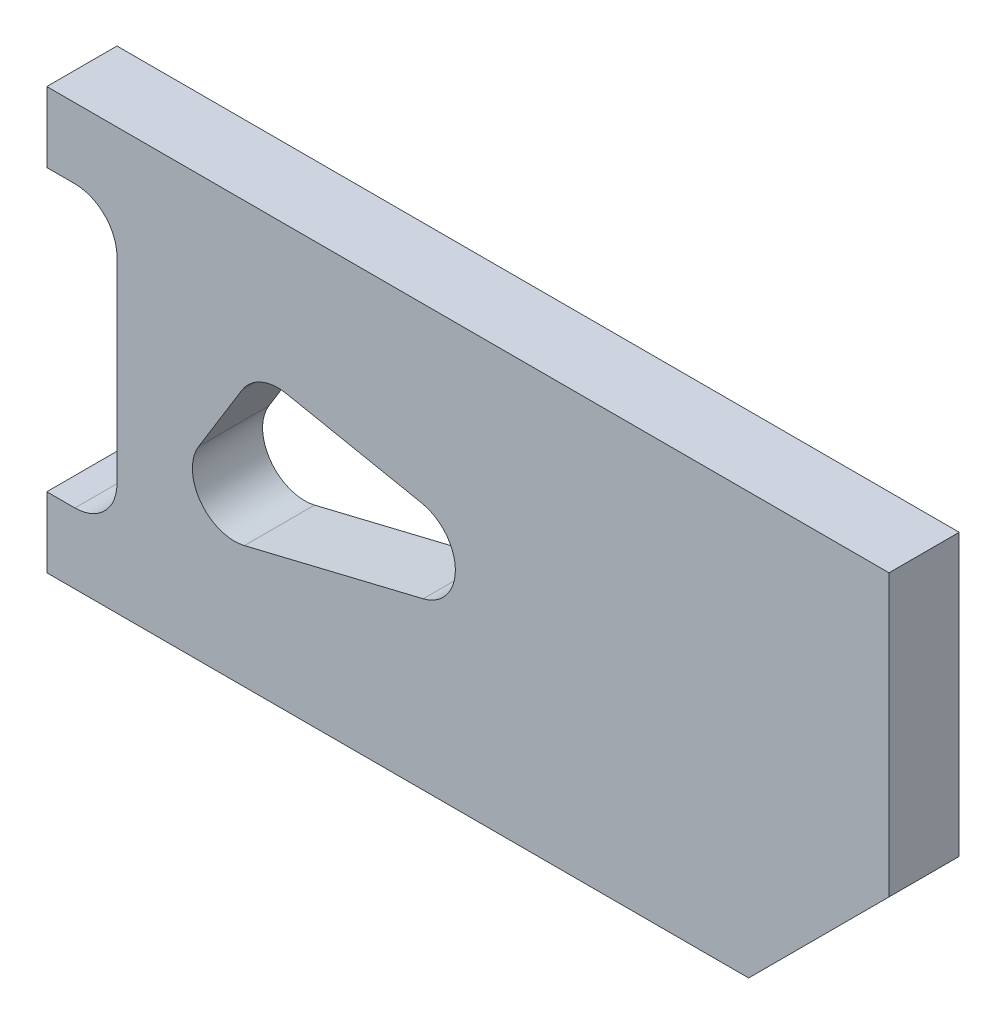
from build123d import *

# Parameters (mm, degrees)
EXTRUDE_1_DEPTH = 5


with BuildPart() as part:
    # Sketch 1 → Extrude 1 (new body)
    with BuildSketch(Plane.XY):
        with BuildLine():
            Line((0, 5), (0, 0))
            Line((0, 0), (50, 0))
            Line((50, 0), (60, 10))
            Line((60, 10), (60, 30))
            Line((60, 30), (0, 30))
            Line((0, 30), (0, 25))
            Line((0, 25), (2, 25))
            ThreePointArc((2, 25), (4.121320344, 24.121320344), (5, 22))
            Line((5, 22), (5, 8))
            ThreePointArc((5, 8), (4.121320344, 5.878679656), (2, 5))
            Line((2, 5), (0, 5))
        make_face()
        with BuildLine():
            ThreePointArc((14.079703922, 8.71629186), (10.946152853, 9.868073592), (10.817928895, 13.204134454))
            Line((10.817928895, 13.204134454), (13.905142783, 18.220857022))
            ThreePointArc((13.905142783, 18.220857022), (15.261888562, 19.398882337), (17.048466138, 19.590306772))
            Line((17.048466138, 19.590306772), (26.696009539, 17.660798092))
            ThreePointArc((26.696009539, 17.660798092), (29.107047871, 14.779712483), (26.814461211, 11.803505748))
            Line((26.814461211, 11.803505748), (14.079703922, 8.71629186))
        make_face(mode=Mode.SUBTRACT)
    extrude(amount=EXTRUDE_1_DEPTH)


solid = part.part
